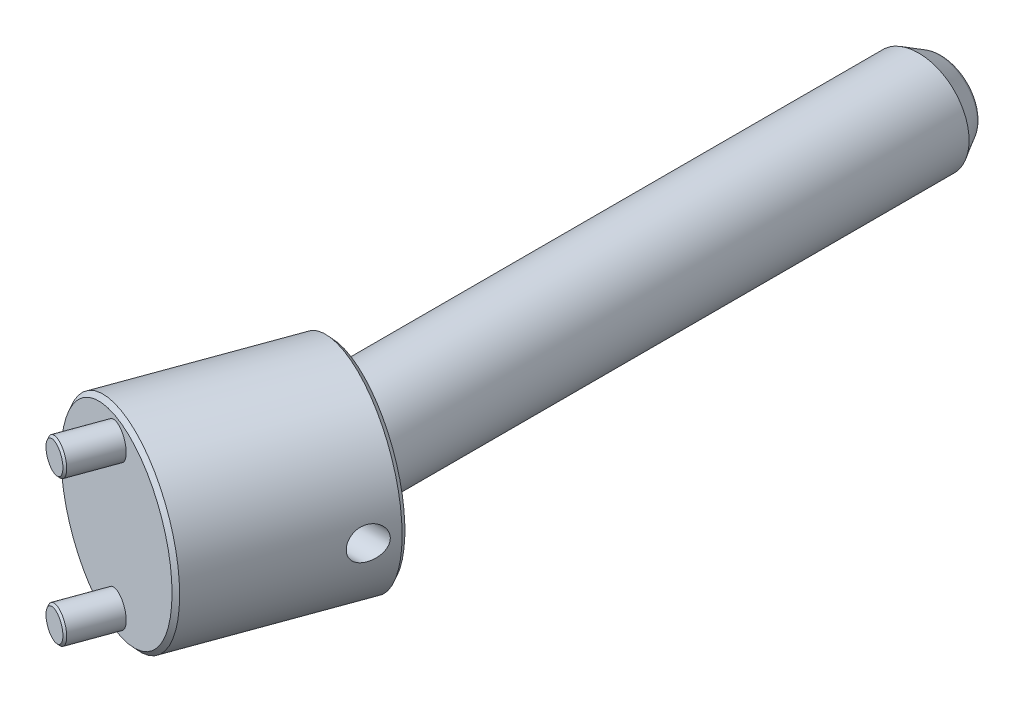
ISO-10303-21;
HEADER;
FILE_DESCRIPTION(('STEP AP214'),'2;1');
FILE_NAME('part.step','',(''),(''),'','','');
FILE_SCHEMA(('AUTOMOTIVE_DESIGN { 1 0 10303 214 1 1 1 1 }'));
ENDSEC;
DATA;
#1=APPLICATION_CONTEXT('core data for automotive mechanical design processes');
#2=APPLICATION_PROTOCOL_DEFINITION('international standard','automotive_design',2000,#1);
#3=PRODUCT_CONTEXT('',#1,'mechanical');
#4=PRODUCT('Part','Part','',(#3));
#5=PRODUCT_RELATED_PRODUCT_CATEGORY('part','',(#4));
#6=PRODUCT_DEFINITION_FORMATION('','',#4);
#7=PRODUCT_DEFINITION_CONTEXT('part definition',#1,'design');
#8=PRODUCT_DEFINITION('design','',#6,#7);
#9=PRODUCT_DEFINITION_SHAPE('','',#8);
#10=(LENGTH_UNIT() NAMED_UNIT(*) SI_UNIT(.MILLI.,.METRE.));
#11=(NAMED_UNIT(*) PLANE_ANGLE_UNIT() SI_UNIT($,.RADIAN.));
#12=(NAMED_UNIT(*) SI_UNIT($,.STERADIAN.) SOLID_ANGLE_UNIT());
#13=UNCERTAINTY_MEASURE_WITH_UNIT(LENGTH_MEASURE(1.E-05),#10,'distance_accuracy_value','');
#14=(GEOMETRIC_REPRESENTATION_CONTEXT(3) GLOBAL_UNCERTAINTY_ASSIGNED_CONTEXT((#13)) GLOBAL_UNIT_ASSIGNED_CONTEXT((#10,
#11,#12)) REPRESENTATION_CONTEXT('',''));
#15=CARTESIAN_POINT('',(0.,0.,0.));
#16=DIRECTION('',(0.,0.,1.));
#17=DIRECTION('',(1.,0.,0.));
#18=AXIS2_PLACEMENT_3D('',#15,#16,#17);
#19=CARTESIAN_POINT('',(0.,0.,-150.));
#20=DIRECTION('',(0.,0.,-1.));
#21=DIRECTION('',(0.,1.,0.));
#22=AXIS2_PLACEMENT_3D('',#19,#20,#21);
#23=PLANE('',#22);
#24=CARTESIAN_POINT('',(0.,0.,-150.));
#25=DIRECTION('',(0.,0.,1.));
#26=DIRECTION('',(-1.,0.,0.));
#27=AXIS2_PLACEMENT_3D('',#24,#25,#26);
#28=CIRCLE('',#27,7.881197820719);
#29=CARTESIAN_POINT('',(-7.8811978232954,0.,-150.));
#30=VERTEX_POINT('',#29);
#31=CARTESIAN_POINT('',(7.8811978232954,0.,-150.));
#32=VERTEX_POINT('',#31);
#33=EDGE_CURVE('P0_E38',#30,#32,#28,.T.);
#34=ORIENTED_EDGE('',*,*,#33,.F.);
#35=CARTESIAN_POINT('',(0.,0.,-150.));
#36=DIRECTION('',(0.,0.,1.));
#37=DIRECTION('',(1.,0.,0.));
#38=AXIS2_PLACEMENT_3D('',#35,#36,#37);
#39=CIRCLE('',#38,7.881197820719);
#40=EDGE_CURVE('P0_E42',#32,#30,#39,.T.);
#41=ORIENTED_EDGE('',*,*,#40,.F.);
#42=EDGE_LOOP('',(#34,#41));
#43=FACE_BOUND('',#42,.T.);
#44=ADVANCED_FACE('P0_F17',(#43),#23,.T.);
#45=CARTESIAN_POINT('',(0.,0.,-148.));
#46=DIRECTION('',(0.,0.,-1.));
#47=DIRECTION('',(0.999976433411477,-0.00686532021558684,0.));
#48=AXIS2_PLACEMENT_3D('',#45,#46,#47);
#49=TOROIDAL_SURFACE('',#48,7.881197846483,2.);
#50=ORIENTED_EDGE('',*,*,#33,.T.);
#51=ORIENTED_EDGE('',*,*,#40,.T.);
#52=EDGE_LOOP('',(#50,#51));
#53=FACE_BOUND('',#52,.T.);
#54=CARTESIAN_POINT('',(0.,0.,-149.000000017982));
#55=DIRECTION('',(0.,0.,1.));
#56=DIRECTION('',(1.,0.,0.));
#57=AXIS2_PLACEMENT_3D('',#54,#55,#56);
#58=CIRCLE('',#57,9.61324864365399);
#59=CARTESIAN_POINT('',(9.61324864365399,0.,-149.000000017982));
#60=VERTEX_POINT('',#59);
#61=EDGE_CURVE('P0_E48',#60,#60,#58,.T.);
#62=ORIENTED_EDGE('',*,*,#61,.F.);
#63=EDGE_LOOP('',(#62));
#64=FACE_BOUND('',#63,.T.);
#65=ADVANCED_FACE('P0_F40',(#53,#64),#49,.T.);
#66=CARTESIAN_POINT('',(0.,0.,37.5));
#67=DIRECTION('',(0.,0.,-1.));
#68=DIRECTION('',(0.,1.,0.));
#69=AXIS2_PLACEMENT_3D('',#66,#67,#68);
#70=PLANE('',#69);
#71=CARTESIAN_POINT('',(0.,0.,37.4999998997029));
#72=DIRECTION('',(0.,0.,-1.));
#73=DIRECTION('',(0.,1.,0.));
#74=AXIS2_PLACEMENT_3D('',#71,#72,#73);
#75=CIRCLE('',#74,11.4999995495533);
#76=CARTESIAN_POINT('',(0.,11.4999995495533,37.4999998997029));
#77=VERTEX_POINT('',#76);
#78=EDGE_CURVE('P0_E85',#77,#77,#75,.T.);
#79=ORIENTED_EDGE('',*,*,#78,.F.);
#80=EDGE_LOOP('',(#79));
#81=FACE_BOUND('',#80,.T.);
#82=ADVANCED_FACE('P0_F76',(#81),#70,.F.);
#83=CARTESIAN_POINT('',(4.30940107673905,0.,17.));
#84=DIRECTION('',(1.,0.,0.));
#85=DIRECTION('',(0.,0.,1.));
#86=AXIS2_PLACEMENT_3D('',#83,#84,#85);
#87=CONICAL_SURFACE('',#86,3.9999999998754,1.04719755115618);
#88=CARTESIAN_POINT('',(1.99999999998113,0.,16.9999999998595));
#89=VERTEX_POINT('',#88);
#90=VERTEX_LOOP('',#89);
#91=FACE_BOUND('',#90,.T.);
#92=CARTESIAN_POINT('',(4.309401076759,0.,17.));
#93=DIRECTION('',(1.,0.,0.));
#94=DIRECTION('',(0.,0.,1.));
#95=AXIS2_PLACEMENT_3D('',#92,#93,#94);
#96=CIRCLE('',#95,4.);
#97=CARTESIAN_POINT('',(4.309401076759,0.,21.));
#98=VERTEX_POINT('',#97);
#99=EDGE_CURVE('P0_E82',#98,#98,#96,.T.);
#100=ORIENTED_EDGE('',*,*,#99,.T.);
#101=EDGE_LOOP('',(#100));
#102=FACE_BOUND('',#101,.T.);
#103=ADVANCED_FACE('P0_F116',(#91,#102),#87,.F.);
#104=CARTESIAN_POINT('',(0.,0.,-143.999999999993));
#105=DIRECTION('',(0.,0.,1.));
#106=DIRECTION('',(0.,-1.,0.));
#107=AXIS2_PLACEMENT_3D('',#104,#105,#106);
#108=CONICAL_SURFACE('',#107,12.4999999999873,0.5235987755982);
#109=CARTESIAN_POINT('',(0.,0.,-144.));
#110=DIRECTION('',(0.,0.,-1.));
#111=DIRECTION('',(0.,1.,0.));
#112=AXIS2_PLACEMENT_3D('',#109,#110,#111);
#113=CIRCLE('',#112,12.5);
#114=CARTESIAN_POINT('',(0.,12.5,-144.));
#115=VERTEX_POINT('',#114);
#116=EDGE_CURVE('P0_E92',#115,#115,#113,.F.);
#117=ORIENTED_EDGE('',*,*,#116,.F.);
#118=EDGE_LOOP('',(#117));
#119=FACE_BOUND('',#118,.T.);
#120=ORIENTED_EDGE('',*,*,#61,.T.);
#121=EDGE_LOOP('',(#120));
#122=FACE_BOUND('',#121,.T.);
#123=ADVANCED_FACE('P0_F108',(#119,#122),#108,.T.);
#124=CARTESIAN_POINT('',(0.,0.,36.4999995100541));
#125=DIRECTION('',(0.,0.,-1.));
#126=DIRECTION('',(0.,1.,0.));
#127=AXIS2_PLACEMENT_3D('',#124,#125,#126);
#128=CONICAL_SURFACE('',#127,12.4999998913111,0.785398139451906);
#129=CARTESIAN_POINT('',(0.,0.,36.499999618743));
#130=DIRECTION('',(0.,0.,-1.));
#131=DIRECTION('',(0.,1.,0.));
#132=AXIS2_PLACEMENT_3D('',#129,#130,#131);
#133=CIRCLE('',#132,12.5);
#134=CARTESIAN_POINT('',(0.,12.5,36.499999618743));
#135=VERTEX_POINT('',#134);
#136=EDGE_CURVE('P0_E28',#135,#135,#133,.T.);
#137=ORIENTED_EDGE('',*,*,#136,.F.);
#138=EDGE_LOOP('',(#137));
#139=FACE_BOUND('',#138,.T.);
#140=ORIENTED_EDGE('',*,*,#78,.T.);
#141=EDGE_LOOP('',(#140));
#142=FACE_BOUND('',#141,.T.);
#143=ADVANCED_FACE('P0_F105',(#139,#142),#128,.T.);
#144=CARTESIAN_POINT('',(1.375,0.,17.));
#145=DIRECTION('',(1.,0.,0.));
#146=DIRECTION('',(0.,0.,1.));
#147=AXIS2_PLACEMENT_3D('',#144,#145,#146);
#148=CYLINDRICAL_SURFACE('',#147,4.);
#149=ORIENTED_EDGE('',*,*,#99,.F.);
#150=EDGE_LOOP('',(#149));
#151=FACE_BOUND('',#150,.T.);
#152=CARTESIAN_POINT('',(12.5,0.,21.));
#153=CARTESIAN_POINT('',(12.4999998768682,0.109267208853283,20.9999998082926));
#154=CARTESIAN_POINT('',(12.4985638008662,0.218537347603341,20.9955187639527));
#155=CARTESIAN_POINT('',(12.4928582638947,0.436308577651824,20.9776347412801));
#156=CARTESIAN_POINT('',(12.4885877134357,0.544809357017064,20.9642283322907));
#157=CARTESIAN_POINT('',(12.4773197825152,0.760358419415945,20.9285872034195));
#158=CARTESIAN_POINT('',(12.4703188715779,0.867404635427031,20.9063410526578));
#159=CARTESIAN_POINT('',(12.4537844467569,1.07914970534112,20.853228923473));
#160=CARTESIAN_POINT('',(12.4442499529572,1.18384763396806,20.8223596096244));
#161=CARTESIAN_POINT('',(12.412260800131,1.49277788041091,20.7173557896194));
#162=CARTESIAN_POINT('',(12.3863805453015,1.69256281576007,20.6307055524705));
#163=CARTESIAN_POINT('',(12.3281610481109,2.07458913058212,20.4268128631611));
#164=CARTESIAN_POINT('',(12.295822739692,2.25683304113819,20.3095748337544));
#165=CARTESIAN_POINT('',(12.2269279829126,2.60472253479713,20.043795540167));
#166=CARTESIAN_POINT('',(12.1902760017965,2.76972880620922,19.8944408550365));
#167=CARTESIAN_POINT('',(12.1174284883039,3.07283077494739,19.5704010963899));
#168=CARTESIAN_POINT('',(12.0812330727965,3.21091970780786,19.3957096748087));
#169=CARTESIAN_POINT('',(12.01237020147,3.45978450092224,19.0203675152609));
#170=CARTESIAN_POINT('',(11.9798194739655,3.56975347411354,18.8191582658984));
#171=CARTESIAN_POINT('',(11.9233663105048,3.75402351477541,18.399892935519));
#172=CARTESIAN_POINT('',(11.8994614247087,3.82833468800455,18.1818416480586));
#173=CARTESIAN_POINT('',(11.8640030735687,3.93682830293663,17.7422935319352));
#174=CARTESIAN_POINT('',(11.8520853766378,3.97219740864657,17.5211198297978));
#175=CARTESIAN_POINT('',(11.8408707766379,4.00551082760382,17.0756810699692));
#176=CARTESIAN_POINT('',(11.8415703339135,4.00346563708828,16.8514168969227));
#177=CARTESIAN_POINT('',(11.8551904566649,3.96293460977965,16.4160865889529));
#178=CARTESIAN_POINT('',(11.8676003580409,3.92597140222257,16.2048599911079));
#179=CARTESIAN_POINT('',(11.9024113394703,3.81912665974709,15.791778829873));
#180=CARTESIAN_POINT('',(11.9248135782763,3.74924130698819,15.5899253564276));
#181=CARTESIAN_POINT('',(11.9774670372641,3.5774893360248,15.1977500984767));
#182=CARTESIAN_POINT('',(12.0078322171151,3.47515345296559,15.0076498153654));
#183=CARTESIAN_POINT('',(12.0729382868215,3.2417276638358,14.6468343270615));
#184=CARTESIAN_POINT('',(12.107680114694,3.11063158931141,14.4761232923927));
#185=CARTESIAN_POINT('',(12.1796519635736,2.81604951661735,14.1503715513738));
#186=CARTESIAN_POINT('',(12.2169216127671,2.65131653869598,13.9964671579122));
#187=CARTESIAN_POINT('',(12.2883204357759,2.29773509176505,13.7180823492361));
#188=CARTESIAN_POINT('',(12.3224482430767,2.10887621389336,13.5936147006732));
#189=CARTESIAN_POINT('',(12.368603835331,1.8105187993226,13.4313785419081));
#190=CARTESIAN_POINT('',(12.3832112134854,1.70799133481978,13.3811846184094));
#191=CARTESIAN_POINT('',(12.4102662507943,1.49879447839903,13.2896595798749));
#192=CARTESIAN_POINT('',(12.4227147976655,1.39212681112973,13.2483248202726));
#193=CARTESIAN_POINT('',(12.4450730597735,1.17558171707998,13.1749428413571));
#194=CARTESIAN_POINT('',(12.4549867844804,1.0657096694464,13.1428809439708));
#195=CARTESIAN_POINT('',(12.4720081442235,0.843458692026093,13.0882661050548));
#196=CARTESIAN_POINT('',(12.4791170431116,0.731080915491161,13.0657088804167));
#197=CARTESIAN_POINT('',(12.4897717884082,0.515800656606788,13.0320501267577));
#198=CARTESIAN_POINT('',(12.4935992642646,0.413053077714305,13.0200402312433));
#199=CARTESIAN_POINT('',(12.498713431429,0.206871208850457,13.0040150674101));
#200=CARTESIAN_POINT('',(12.5000001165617,0.103436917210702,12.9999998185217));
#201=CARTESIAN_POINT('',(12.4999998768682,-0.109267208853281,13.0000001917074));
#202=CARTESIAN_POINT('',(12.4985638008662,-0.218537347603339,13.0044812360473));
#203=CARTESIAN_POINT('',(12.4928582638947,-0.436308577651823,13.0223652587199));
#204=CARTESIAN_POINT('',(12.4885877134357,-0.544809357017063,13.0357716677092));
#205=CARTESIAN_POINT('',(12.4773197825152,-0.760358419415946,13.0714127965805));
#206=CARTESIAN_POINT('',(12.4703188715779,-0.867404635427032,13.0936589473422));
#207=CARTESIAN_POINT('',(12.4537844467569,-1.07914970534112,13.146771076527));
#208=CARTESIAN_POINT('',(12.4442499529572,-1.18384763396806,13.1776403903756));
#209=CARTESIAN_POINT('',(12.412260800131,-1.4927778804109,13.2826442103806));
#210=CARTESIAN_POINT('',(12.3863805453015,-1.69256281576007,13.3692944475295));
#211=CARTESIAN_POINT('',(12.3281610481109,-2.07458913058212,13.5731871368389));
#212=CARTESIAN_POINT('',(12.295822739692,-2.25683304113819,13.6904251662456));
#213=CARTESIAN_POINT('',(12.2269279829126,-2.60472253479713,13.956204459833));
#214=CARTESIAN_POINT('',(12.1902760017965,-2.76972880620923,14.1055591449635));
#215=CARTESIAN_POINT('',(12.1174284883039,-3.0728307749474,14.4295989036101));
#216=CARTESIAN_POINT('',(12.0812330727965,-3.21091970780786,14.6042903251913));
#217=CARTESIAN_POINT('',(12.01237020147,-3.45978450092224,14.9796324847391));
#218=CARTESIAN_POINT('',(11.9798194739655,-3.56975347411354,15.1808417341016));
#219=CARTESIAN_POINT('',(11.9233663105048,-3.75402351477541,15.600107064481));
#220=CARTESIAN_POINT('',(11.8994614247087,-3.82833468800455,15.8181583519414));
#221=CARTESIAN_POINT('',(11.8640030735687,-3.93682830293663,16.2577064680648));
#222=CARTESIAN_POINT('',(11.8520853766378,-3.97219740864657,16.4788801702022));
#223=CARTESIAN_POINT('',(11.8408707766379,-4.00551082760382,16.9243189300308));
#224=CARTESIAN_POINT('',(11.8415703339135,-4.00346563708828,17.1485831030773));
#225=CARTESIAN_POINT('',(11.8551904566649,-3.96293460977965,17.583913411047));
#226=CARTESIAN_POINT('',(11.8676003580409,-3.92597140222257,17.7951400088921));
#227=CARTESIAN_POINT('',(11.9024113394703,-3.81912665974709,18.208221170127));
#228=CARTESIAN_POINT('',(11.9248135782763,-3.74924130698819,18.4100746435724));
#229=CARTESIAN_POINT('',(11.9774670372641,-3.5774893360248,18.8022499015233));
#230=CARTESIAN_POINT('',(12.0078322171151,-3.47515345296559,18.9923501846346));
#231=CARTESIAN_POINT('',(12.0729382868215,-3.2417276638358,19.3531656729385));
#232=CARTESIAN_POINT('',(12.107680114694,-3.11063158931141,19.5238767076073));
#233=CARTESIAN_POINT('',(12.1796519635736,-2.81604951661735,19.8496284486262));
#234=CARTESIAN_POINT('',(12.2169216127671,-2.65131653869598,20.0035328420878));
#235=CARTESIAN_POINT('',(12.2883204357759,-2.29773509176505,20.2819176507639));
#236=CARTESIAN_POINT('',(12.3224482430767,-2.10887621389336,20.4063852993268));
#237=CARTESIAN_POINT('',(12.368603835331,-1.8105187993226,20.5686214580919));
#238=CARTESIAN_POINT('',(12.3832112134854,-1.70799133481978,20.6188153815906));
#239=CARTESIAN_POINT('',(12.4102662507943,-1.49879447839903,20.7103404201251));
#240=CARTESIAN_POINT('',(12.4227147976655,-1.39212681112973,20.7516751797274));
#241=CARTESIAN_POINT('',(12.4450730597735,-1.17558171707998,20.8250571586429));
#242=CARTESIAN_POINT('',(12.4549867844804,-1.0657096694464,20.8571190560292));
#243=CARTESIAN_POINT('',(12.4720081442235,-0.843458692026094,20.9117338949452));
#244=CARTESIAN_POINT('',(12.4791170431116,-0.731080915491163,20.9342911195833));
#245=CARTESIAN_POINT('',(12.4897717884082,-0.515800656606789,20.9679498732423));
#246=CARTESIAN_POINT('',(12.4935992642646,-0.413053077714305,20.9799597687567));
#247=CARTESIAN_POINT('',(12.498713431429,-0.206871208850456,20.9959849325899));
#248=CARTESIAN_POINT('',(12.5000001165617,-0.103436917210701,21.0000001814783));
#249=CARTESIAN_POINT('',(12.5,0.,21.));
#250=B_SPLINE_CURVE_WITH_KNOTS('',3,(#152,#153,#154,#155,#156,#157,#158,#159,#160,#161,#162,
#163,#164,#165,#166,#167,#168,#169,#170,#171,#172,#173,#174,#175,#176,#177,#178,#179,#180,#181,
#182,#183,#184,#185,#186,#187,#188,#189,#190,#191,#192,#193,#194,#195,#196,#197,#198,#199,#200,
#201,#202,#203,#204,#205,#206,#207,#208,#209,#210,#211,#212,#213,#214,#215,#216,#217,#218,#219,
#220,#221,#222,#223,#224,#225,#226,#227,#228,#229,#230,#231,#232,#233,#234,#235,#236,#237,#238,
#239,#240,#241,#242,#243,#244,#245,#246,#247,#248,#249),.UNSPECIFIED.,.T.,.F.,(4,2,2,2,2,2,2,2,
2,2,2,2,2,2,2,2,2,2,2,2,2,2,2,2,2,2,2,2,2,2,2,2,2,2,2,2,2,2,2,2,2,2,2,2,2,2,2,2,4),(0.,
0.327705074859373,0.655536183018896,0.983792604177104,1.31217617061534,1.96678919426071,
2.62130761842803,3.29492000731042,3.96870146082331,4.66006760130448,5.35123768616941,
6.0207071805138,6.68998886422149,7.33137068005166,7.97282689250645,8.62401811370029,
9.27534913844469,9.95775723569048,10.6404607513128,10.9853574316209,11.3301119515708,
11.6743177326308,12.0183682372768,12.3285868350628,12.6388061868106,12.9665112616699,
13.2943423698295,13.6225987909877,13.9509823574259,14.6055953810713,15.2601138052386,
15.933726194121,16.6075076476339,17.298873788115,17.99004387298,18.6595133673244,
19.3287950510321,19.9701768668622,20.611633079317,21.2628243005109,21.9141553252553,
22.596563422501,23.2792669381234,23.6241636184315,23.9689181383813,24.3131239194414,
24.6571744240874,24.9673930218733,25.2776123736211),.UNSPECIFIED.);
#251=CARTESIAN_POINT('',(12.5,0.,21.));
#252=VERTEX_POINT('',#251);
#253=EDGE_CURVE('P0_E11',#252,#252,#250,.T.);
#254=ORIENTED_EDGE('',*,*,#253,.F.);
#255=EDGE_LOOP('',(#254));
#256=FACE_BOUND('',#255,.T.);
#257=ADVANCED_FACE('P0_F107',(#151,#256),#148,.F.);
#258=CARTESIAN_POINT('',(0.,0.,46.875));
#259=DIRECTION('',(0.,0.,-1.));
#260=DIRECTION('',(0.,1.,0.));
#261=AXIS2_PLACEMENT_3D('',#258,#259,#260);
#262=CYLINDRICAL_SURFACE('',#261,12.5);
#263=ORIENTED_EDGE('',*,*,#116,.T.);
#264=EDGE_LOOP('',(#263));
#265=FACE_BOUND('',#264,.T.);
#266=ORIENTED_EDGE('',*,*,#136,.T.);
#267=EDGE_LOOP('',(#266));
#268=FACE_BOUND('',#267,.T.);
#269=ORIENTED_EDGE('',*,*,#253,.T.);
#270=EDGE_LOOP('',(#269));
#271=FACE_BOUND('',#270,.T.);
#272=ADVANCED_FACE('P0_F102',(#265,#268,#271),#262,.T.);
#273=CLOSED_SHELL('',(#44,#65,#82,#103,#123,#143,#257,#272));
#274=MANIFOLD_SOLID_BREP('P0_B1',#273);
#275=CARTESIAN_POINT('',(-14.7966850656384,0.,55.2725801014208));
#276=DIRECTION('',(-0.342020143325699,0.,0.939692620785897));
#277=DIRECTION('',(-0.939692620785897,0.,-0.342020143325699));
#278=AXIS2_PLACEMENT_3D('',#275,#276,#277);
#279=PLANE('',#278);
#280=CARTESIAN_POINT('',(-14.7966850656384,18.,55.2725801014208));
#281=DIRECTION('',(-0.342020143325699,0.,0.939692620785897));
#282=DIRECTION('',(-0.939692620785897,0.,-0.342020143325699));
#283=AXIS2_PLACEMENT_3D('',#280,#281,#282);
#284=CIRCLE('',#283,3.50000030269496);
#285=CARTESIAN_POINT('',(-18.0856095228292,18.,54.0755094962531));
#286=VERTEX_POINT('',#285);
#287=EDGE_CURVE('P1_E17',#286,#286,#284,.F.);
#288=ORIENTED_EDGE('',*,*,#287,.F.);
#289=EDGE_LOOP('',(#288));
#290=FACE_BOUND('',#289,.T.);
#291=ADVANCED_FACE('P1_F14',(#290),#279,.T.);
#292=CARTESIAN_POINT('',(-14.7966850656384,0.,55.2725801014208));
#293=DIRECTION('',(-0.342020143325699,0.,0.939692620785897));
#294=DIRECTION('',(-0.939692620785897,0.,-0.342020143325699));
#295=AXIS2_PLACEMENT_3D('',#292,#293,#294);
#296=PLANE('',#295);
#297=CARTESIAN_POINT('',(-14.7966850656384,-18.,55.2725801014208));
#298=DIRECTION('',(-0.342020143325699,0.,0.939692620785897));
#299=DIRECTION('',(-0.939692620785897,0.,-0.342020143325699));
#300=AXIS2_PLACEMENT_3D('',#297,#298,#299);
#301=CIRCLE('',#300,3.50000030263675);
#302=CARTESIAN_POINT('',(-18.0856095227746,-18.,54.075509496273));
#303=VERTEX_POINT('',#302);
#304=EDGE_CURVE('P1_E121',#303,#303,#301,.F.);
#305=ORIENTED_EDGE('',*,*,#304,.F.);
#306=EDGE_LOOP('',(#305));
#307=FACE_BOUND('',#306,.T.);
#308=ADVANCED_FACE('P1_F111',(#307),#296,.T.);
#309=CARTESIAN_POINT('',(-3.98986399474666E-12,0.,37.4999999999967));
#310=DIRECTION('',(0.,0.,1.));
#311=DIRECTION('',(-1.,0.,0.));
#312=AXIS2_PLACEMENT_3D('',#309,#310,#311);
#313=PLANE('',#312);
#314=CARTESIAN_POINT('',(-4.41834069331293E-12,0.,37.4999999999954));
#315=DIRECTION('',(0.,0.,1.));
#316=DIRECTION('',(-1.,0.,0.));
#317=AXIS2_PLACEMENT_3D('',#314,#315,#316);
#318=CIRCLE('',#317,12.5);
#319=CARTESIAN_POINT('',(-12.5000000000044,0.,37.4999999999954));
#320=VERTEX_POINT('',#319);
#321=EDGE_CURVE('P1_E36',#320,#320,#318,.F.);
#322=ORIENTED_EDGE('',*,*,#321,.T.);
#323=EDGE_LOOP('',(#322));
#324=FACE_BOUND('',#323,.T.);
#325=ADVANCED_FACE('P1_F108',(#324),#313,.F.);
#326=CARTESIAN_POINT('',(-14.6256745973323,18.,54.8027327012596));
#327=DIRECTION('',(0.342020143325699,0.,-0.939692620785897));
#328=DIRECTION('',(0.939692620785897,0.,0.342020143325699));
#329=AXIS2_PLACEMENT_3D('',#326,#327,#328);
#330=CONICAL_SURFACE('',#329,4.00000150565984,0.785398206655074);
#331=CARTESIAN_POINT('',(-14.6256740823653,18.,54.8027312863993));
#332=DIRECTION('',(-0.342020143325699,0.,0.939692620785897));
#333=DIRECTION('',(-0.939692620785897,0.,-0.342020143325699));
#334=AXIS2_PLACEMENT_3D('',#331,#332,#333);
#335=CIRCLE('',#334,4.);
#336=CARTESIAN_POINT('',(-18.3844445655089,18.,53.4346507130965));
#337=VERTEX_POINT('',#336);
#338=EDGE_CURVE('P1_E33',#337,#337,#335,.F.);
#339=ORIENTED_EDGE('',*,*,#338,.F.);
#340=EDGE_LOOP('',(#339));
#341=FACE_BOUND('',#340,.T.);
#342=ORIENTED_EDGE('',*,*,#287,.T.);
#343=EDGE_LOOP('',(#342));
#344=FACE_BOUND('',#343,.T.);
#345=ADVANCED_FACE('P1_F104',(#341,#344),#330,.T.);
#346=CARTESIAN_POINT('',(-14.6256745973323,-18.,54.8027327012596));
#347=DIRECTION('',(0.342020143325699,0.,-0.939692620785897));
#348=DIRECTION('',(0.939692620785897,0.,0.342020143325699));
#349=AXIS2_PLACEMENT_3D('',#346,#347,#348);
#350=CONICAL_SURFACE('',#349,4.00000150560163,0.785398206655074);
#351=CARTESIAN_POINT('',(-14.6256740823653,-18.,54.8027312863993));
#352=DIRECTION('',(-0.342020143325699,0.,0.939692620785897));
#353=DIRECTION('',(-0.939692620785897,0.,-0.342020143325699));
#354=AXIS2_PLACEMENT_3D('',#351,#352,#353);
#355=CIRCLE('',#354,4.);
#356=CARTESIAN_POINT('',(-18.3844445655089,-18.,53.4346507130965));
#357=VERTEX_POINT('',#356);
#358=EDGE_CURVE('P1_E29',#357,#357,#355,.F.);
#359=ORIENTED_EDGE('',*,*,#358,.F.);
#360=EDGE_LOOP('',(#359));
#361=FACE_BOUND('',#360,.T.);
#362=ORIENTED_EDGE('',*,*,#304,.T.);
#363=EDGE_LOOP('',(#362));
#364=FACE_BOUND('',#363,.T.);
#365=ADVANCED_FACE('P1_F99',(#361,#364),#350,.T.);
#366=CARTESIAN_POINT('',(-4.41834069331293E-12,0.,-16.7941648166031));
#367=DIRECTION('',(0.,0.,1.));
#368=DIRECTION('',(-1.,0.,0.));
#369=AXIS2_PLACEMENT_3D('',#366,#367,#368);
#370=CYLINDRICAL_SURFACE('',#369,12.5);
#371=CARTESIAN_POINT('',(-4.41834069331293E-12,0.,-4.37844205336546E-12));
#372=DIRECTION('',(0.342020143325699,0.,-0.939692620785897));
#373=DIRECTION('',(0.939692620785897,0.,0.342020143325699));
#374=AXIS2_PLACEMENT_3D('',#371,#372,#373);
#375=ELLIPSE('',#374,13.3022221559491,12.5);
#376=CARTESIAN_POINT('',(12.4999999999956,0.,4.54962792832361));
#377=VERTEX_POINT('',#376);
#378=EDGE_CURVE('P1_E32',#377,#377,#375,.F.);
#379=ORIENTED_EDGE('',*,*,#378,.F.);
#380=EDGE_LOOP('',(#379));
#381=FACE_BOUND('',#380,.T.);
#382=ORIENTED_EDGE('',*,*,#321,.F.);
#383=EDGE_LOOP('',(#382));
#384=FACE_BOUND('',#383,.T.);
#385=CARTESIAN_POINT('',(12.4999999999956,0.,12.9999999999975));
#386=CARTESIAN_POINT('',(12.4999998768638,0.109267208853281,13.000000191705));
#387=CARTESIAN_POINT('',(12.4985638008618,0.218537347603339,13.0044812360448));
#388=CARTESIAN_POINT('',(12.4928582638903,0.436308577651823,13.0223652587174));
#389=CARTESIAN_POINT('',(12.4885877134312,0.544809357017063,13.0357716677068));
#390=CARTESIAN_POINT('',(12.4773197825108,0.760358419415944,13.071412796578));
#391=CARTESIAN_POINT('',(12.4703188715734,0.86740463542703,13.0936589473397));
#392=CARTESIAN_POINT('',(12.4537844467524,1.07914970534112,13.1467710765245));
#393=CARTESIAN_POINT('',(12.4442499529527,1.18384763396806,13.1776403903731));
#394=CARTESIAN_POINT('',(12.4122608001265,1.4927778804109,13.2826442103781));
#395=CARTESIAN_POINT('',(12.386380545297,1.69256281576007,13.369294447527));
#396=CARTESIAN_POINT('',(12.3281610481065,2.07458913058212,13.5731871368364));
#397=CARTESIAN_POINT('',(12.2958227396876,2.25683304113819,13.6904251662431));
#398=CARTESIAN_POINT('',(12.2269279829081,2.60472253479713,13.9562044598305));
#399=CARTESIAN_POINT('',(12.1902760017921,2.76972880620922,14.105559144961));
#400=CARTESIAN_POINT('',(12.1174284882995,3.07283077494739,14.4295989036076));
#401=CARTESIAN_POINT('',(12.0812330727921,3.21091970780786,14.6042903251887));
#402=CARTESIAN_POINT('',(12.0123702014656,3.45978450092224,14.9796324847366));
#403=CARTESIAN_POINT('',(11.9798194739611,3.56975347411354,15.1808417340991));
#404=CARTESIAN_POINT('',(11.9233663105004,3.75402351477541,15.6001070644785));
#405=CARTESIAN_POINT('',(11.8994614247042,3.82833468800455,15.8181583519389));
#406=CARTESIAN_POINT('',(11.8640030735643,3.93682830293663,16.2577064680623));
#407=CARTESIAN_POINT('',(11.8520853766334,3.97219740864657,16.4788801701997));
#408=CARTESIAN_POINT('',(11.8408707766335,4.00551082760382,16.9243189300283));
#409=CARTESIAN_POINT('',(11.8415703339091,4.00346563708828,17.1485831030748));
#410=CARTESIAN_POINT('',(11.8551904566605,3.96293460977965,17.5839134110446));
#411=CARTESIAN_POINT('',(11.8676003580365,3.92597140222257,17.7951400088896));
#412=CARTESIAN_POINT('',(11.9024113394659,3.81912665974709,18.2082211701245));
#413=CARTESIAN_POINT('',(11.9248135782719,3.74924130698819,18.4100746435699));
#414=CARTESIAN_POINT('',(11.9774670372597,3.5774893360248,18.8022499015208));
#415=CARTESIAN_POINT('',(12.0078322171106,3.47515345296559,18.9923501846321));
#416=CARTESIAN_POINT('',(12.0729382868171,3.2417276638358,19.353165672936));
#417=CARTESIAN_POINT('',(12.1076801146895,3.11063158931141,19.5238767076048));
#418=CARTESIAN_POINT('',(12.1796519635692,2.81604951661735,19.8496284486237));
#419=CARTESIAN_POINT('',(12.2169216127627,2.65131653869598,20.0035328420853));
#420=CARTESIAN_POINT('',(12.2883204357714,2.29773509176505,20.2819176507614));
#421=CARTESIAN_POINT('',(12.3224482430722,2.10887621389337,20.4063852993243));
#422=CARTESIAN_POINT('',(12.3686038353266,1.81051879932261,20.5686214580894));
#423=CARTESIAN_POINT('',(12.383211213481,1.70799133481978,20.6188153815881));
#424=CARTESIAN_POINT('',(12.4102662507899,1.49879447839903,20.7103404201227));
#425=CARTESIAN_POINT('',(12.422714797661,1.39212681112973,20.7516751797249));
#426=CARTESIAN_POINT('',(12.4450730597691,1.17558171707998,20.8250571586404));
#427=CARTESIAN_POINT('',(12.454986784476,1.0657096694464,20.8571190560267));
#428=CARTESIAN_POINT('',(12.4720081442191,0.843458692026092,20.9117338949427));
#429=CARTESIAN_POINT('',(12.4791170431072,0.731080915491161,20.9342911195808));
#430=CARTESIAN_POINT('',(12.4897717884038,0.515800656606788,20.9679498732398));
#431=CARTESIAN_POINT('',(12.4935992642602,0.413053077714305,20.9799597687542));
#432=CARTESIAN_POINT('',(12.4987134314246,0.206871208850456,20.9959849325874));
#433=CARTESIAN_POINT('',(12.5000001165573,0.103436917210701,21.0000001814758));
#434=CARTESIAN_POINT('',(12.4999998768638,-0.109267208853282,20.9999998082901));
#435=CARTESIAN_POINT('',(12.4985638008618,-0.21853734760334,20.9955187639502));
#436=CARTESIAN_POINT('',(12.4928582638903,-0.436308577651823,20.9776347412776));
#437=CARTESIAN_POINT('',(12.4885877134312,-0.544809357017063,20.9642283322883));
#438=CARTESIAN_POINT('',(12.4773197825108,-0.760358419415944,20.928587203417));
#439=CARTESIAN_POINT('',(12.4703188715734,-0.86740463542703,20.9063410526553));
#440=CARTESIAN_POINT('',(12.4537844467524,-1.07914970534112,20.8532289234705));
#441=CARTESIAN_POINT('',(12.4442499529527,-1.18384763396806,20.8223596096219));
#442=CARTESIAN_POINT('',(12.4122608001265,-1.4927778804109,20.717355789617));
#443=CARTESIAN_POINT('',(12.386380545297,-1.69256281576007,20.630705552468));
#444=CARTESIAN_POINT('',(12.3281610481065,-2.07458913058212,20.4268128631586));
#445=CARTESIAN_POINT('',(12.2958227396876,-2.25683304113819,20.3095748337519));
#446=CARTESIAN_POINT('',(12.2269279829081,-2.60472253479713,20.0437955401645));
#447=CARTESIAN_POINT('',(12.1902760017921,-2.76972880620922,19.894440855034));
#448=CARTESIAN_POINT('',(12.1174284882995,-3.07283077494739,19.5704010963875));
#449=CARTESIAN_POINT('',(12.0812330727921,-3.21091970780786,19.3957096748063));
#450=CARTESIAN_POINT('',(12.0123702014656,-3.45978450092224,19.0203675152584));
#451=CARTESIAN_POINT('',(11.979819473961,-3.56975347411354,18.8191582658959));
#452=CARTESIAN_POINT('',(11.9233663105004,-3.75402351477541,18.3998929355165));
#453=CARTESIAN_POINT('',(11.8994614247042,-3.82833468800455,18.1818416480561));
#454=CARTESIAN_POINT('',(11.8640030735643,-3.93682830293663,17.7422935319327));
#455=CARTESIAN_POINT('',(11.8520853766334,-3.97219740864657,17.5211198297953));
#456=CARTESIAN_POINT('',(11.8408707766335,-4.00551082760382,17.0756810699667));
#457=CARTESIAN_POINT('',(11.8415703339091,-4.00346563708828,16.8514168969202));
#458=CARTESIAN_POINT('',(11.8551904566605,-3.96293460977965,16.4160865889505));
#459=CARTESIAN_POINT('',(11.8676003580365,-3.92597140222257,16.2048599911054));
#460=CARTESIAN_POINT('',(11.9024113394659,-3.81912665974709,15.7917788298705));
#461=CARTESIAN_POINT('',(11.9248135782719,-3.74924130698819,15.5899253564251));
#462=CARTESIAN_POINT('',(11.9774670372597,-3.5774893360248,15.1977500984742));
#463=CARTESIAN_POINT('',(12.0078322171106,-3.47515345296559,15.0076498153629));
#464=CARTESIAN_POINT('',(12.0729382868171,-3.2417276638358,14.646834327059));
#465=CARTESIAN_POINT('',(12.1076801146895,-3.11063158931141,14.4761232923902));
#466=CARTESIAN_POINT('',(12.1796519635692,-2.81604951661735,14.1503715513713));
#467=CARTESIAN_POINT('',(12.2169216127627,-2.65131653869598,13.9964671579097));
#468=CARTESIAN_POINT('',(12.2883204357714,-2.29773509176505,13.7180823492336));
#469=CARTESIAN_POINT('',(12.3224482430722,-2.10887621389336,13.5936147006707));
#470=CARTESIAN_POINT('',(12.3686038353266,-1.81051879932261,13.4313785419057));
#471=CARTESIAN_POINT('',(12.383211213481,-1.70799133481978,13.3811846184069));
#472=CARTESIAN_POINT('',(12.4102662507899,-1.49879447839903,13.2896595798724));
#473=CARTESIAN_POINT('',(12.422714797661,-1.39212681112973,13.2483248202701));
#474=CARTESIAN_POINT('',(12.4450730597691,-1.17558171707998,13.1749428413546));
#475=CARTESIAN_POINT('',(12.454986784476,-1.0657096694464,13.1428809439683));
#476=CARTESIAN_POINT('',(12.4720081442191,-0.843458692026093,13.0882661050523));
#477=CARTESIAN_POINT('',(12.4791170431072,-0.731080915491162,13.0657088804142));
#478=CARTESIAN_POINT('',(12.4897717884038,-0.51580065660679,13.0320501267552));
#479=CARTESIAN_POINT('',(12.4935992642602,-0.413053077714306,13.0200402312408));
#480=CARTESIAN_POINT('',(12.4987134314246,-0.206871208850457,13.0040150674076));
#481=CARTESIAN_POINT('',(12.5000001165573,-0.103436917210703,12.9999998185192));
#482=CARTESIAN_POINT('',(12.4999999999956,0.,12.9999999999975));
#483=B_SPLINE_CURVE_WITH_KNOTS('',3,(#385,#386,#387,#388,#389,#390,#391,#392,#393,#394,#395,
#396,#397,#398,#399,#400,#401,#402,#403,#404,#405,#406,#407,#408,#409,#410,#411,#412,#413,#414,
#415,#416,#417,#418,#419,#420,#421,#422,#423,#424,#425,#426,#427,#428,#429,#430,#431,#432,#433,
#434,#435,#436,#437,#438,#439,#440,#441,#442,#443,#444,#445,#446,#447,#448,#449,#450,#451,#452,
#453,#454,#455,#456,#457,#458,#459,#460,#461,#462,#463,#464,#465,#466,#467,#468,#469,#470,#471,
#472,#473,#474,#475,#476,#477,#478,#479,#480,#481,#482),.UNSPECIFIED.,.T.,.F.,(4,2,2,2,2,2,2,2,
2,2,2,2,2,2,2,2,2,2,2,2,2,2,2,2,2,2,2,2,2,2,2,2,2,2,2,2,2,2,2,2,2,2,2,2,2,2,2,2,4),(0.,
0.327705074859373,0.655536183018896,0.983792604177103,1.31217617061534,1.9667891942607,
2.62130761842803,3.29492000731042,3.9687014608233,4.66006760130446,5.3512376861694,
6.0207071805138,6.68998886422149,7.33137068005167,7.97282689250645,8.62401811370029,
9.27534913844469,9.95775723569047,10.6404607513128,10.9853574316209,11.3301119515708,
11.6743177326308,12.0183682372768,12.3285868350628,12.6388061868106,12.9665112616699,
13.2943423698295,13.6225987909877,13.9509823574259,14.6055953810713,15.2601138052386,
15.933726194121,16.6075076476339,17.298873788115,17.99004387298,18.6595133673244,
19.3287950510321,19.9701768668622,20.611633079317,21.2628243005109,21.9141553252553,
22.596563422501,23.2792669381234,23.6241636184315,23.9689181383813,24.3131239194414,
24.6571744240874,24.9673930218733,25.2776123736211),.UNSPECIFIED.);
#484=CARTESIAN_POINT('',(12.4999999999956,0.,12.9999999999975));
#485=VERTEX_POINT('',#484);
#486=EDGE_CURVE('P1_E84',#485,#485,#483,.T.);
#487=ORIENTED_EDGE('',*,*,#486,.T.);
#488=EDGE_LOOP('',(#487));
#489=FACE_BOUND('',#488,.T.);
#490=ADVANCED_FACE('P1_F93',(#381,#384,#489),#370,.F.);
#491=CARTESIAN_POINT('',(-10.69244334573,18.,43.99626865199));
#492=DIRECTION('',(-0.342020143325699,0.,0.939692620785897));
#493=DIRECTION('',(-0.939692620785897,0.,-0.342020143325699));
#494=AXIS2_PLACEMENT_3D('',#491,#492,#493);
#495=CYLINDRICAL_SURFACE('',#494,4.);
#496=CARTESIAN_POINT('',(-10.69244334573,18.,43.99626865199));
#497=DIRECTION('',(-0.342020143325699,0.,0.939692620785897));
#498=DIRECTION('',(-0.939692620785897,0.,-0.342020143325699));
#499=AXIS2_PLACEMENT_3D('',#496,#497,#498);
#500=CIRCLE('',#499,4.);
#501=CARTESIAN_POINT('',(-14.4512138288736,18.,42.6281880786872));
#502=VERTEX_POINT('',#501);
#503=EDGE_CURVE('P1_E80',#502,#502,#500,.T.);
#504=ORIENTED_EDGE('',*,*,#503,.T.);
#505=EDGE_LOOP('',(#504));
#506=FACE_BOUND('',#505,.T.);
#507=ORIENTED_EDGE('',*,*,#338,.T.);
#508=EDGE_LOOP('',(#507));
#509=FACE_BOUND('',#508,.T.);
#510=ADVANCED_FACE('P1_F98',(#506,#509),#495,.T.);
#511=CARTESIAN_POINT('',(-10.69244334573,-18.,43.99626865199));
#512=DIRECTION('',(-0.342020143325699,0.,0.939692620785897));
#513=DIRECTION('',(-0.939692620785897,0.,-0.342020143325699));
#514=AXIS2_PLACEMENT_3D('',#511,#512,#513);
#515=CYLINDRICAL_SURFACE('',#514,4.);
#516=CARTESIAN_POINT('',(-10.69244334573,-18.,43.99626865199));
#517=DIRECTION('',(-0.342020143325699,0.,0.939692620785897));
#518=DIRECTION('',(-0.939692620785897,0.,-0.342020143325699));
#519=AXIS2_PLACEMENT_3D('',#516,#517,#518);
#520=CIRCLE('',#519,4.);
#521=CARTESIAN_POINT('',(-14.4512138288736,-18.,42.6281880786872));
#522=VERTEX_POINT('',#521);
#523=EDGE_CURVE('P1_E76',#522,#522,#520,.T.);
#524=ORIENTED_EDGE('',*,*,#523,.T.);
#525=EDGE_LOOP('',(#524));
#526=FACE_BOUND('',#525,.T.);
#527=ORIENTED_EDGE('',*,*,#358,.T.);
#528=EDGE_LOOP('',(#527));
#529=FACE_BOUND('',#528,.T.);
#530=ADVANCED_FACE('P1_F178',(#526,#529),#515,.T.);
#531=CARTESIAN_POINT('',(4.69846310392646,0.,1.71010071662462));
#532=DIRECTION('',(0.342020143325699,0.,-0.939692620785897));
#533=DIRECTION('',(0.939692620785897,0.,0.342020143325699));
#534=AXIS2_PLACEMENT_3D('',#531,#532,#533);
#535=PLANE('',#534);
#536=ORIENTED_EDGE('',*,*,#378,.T.);
#537=EDGE_LOOP('',(#536));
#538=FACE_BOUND('',#537,.T.);
#539=CARTESIAN_POINT('',(4.6984630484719,0.,1.71010086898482));
#540=DIRECTION('',(-0.342020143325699,0.,0.939692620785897));
#541=DIRECTION('',(-0.939692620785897,0.,-0.342020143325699));
#542=AXIS2_PLACEMENT_3D('',#539,#540,#541);
#543=CIRCLE('',#542,22.9999993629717);
#544=CARTESIAN_POINT('',(-16.9144666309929,0.,-6.15636220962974));
#545=VERTEX_POINT('',#544);
#546=EDGE_CURVE('P1_E46',#545,#545,#543,.T.);
#547=ORIENTED_EDGE('',*,*,#546,.F.);
#548=EDGE_LOOP('',(#547));
#549=FACE_BOUND('',#548,.T.);
#550=ADVANCED_FACE('P1_F71',(#538,#549),#535,.T.);
#551=CARTESIAN_POINT('',(-7.80115817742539,0.,16.9999999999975));
#552=DIRECTION('',(1.,0.,0.));
#553=DIRECTION('',(0.,0.,1.));
#554=AXIS2_PLACEMENT_3D('',#551,#552,#553);
#555=CYLINDRICAL_SURFACE('',#554,4.);
#556=ORIENTED_EDGE('',*,*,#486,.F.);
#557=EDGE_LOOP('',(#556));
#558=FACE_BOUND('',#557,.T.);
#559=CARTESIAN_POINT('',(23.2177804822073,0.,20.9999999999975));
#560=CARTESIAN_POINT('',(23.2177804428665,0.110523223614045,20.9999995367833));
#561=CARTESIAN_POINT('',(23.2186345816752,0.221058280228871,20.9954155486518));
#562=CARTESIAN_POINT('',(23.2220614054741,0.441386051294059,20.9771102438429));
#563=CARTESIAN_POINT('',(23.2246348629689,0.551178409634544,20.9633848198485));
#564=CARTESIAN_POINT('',(23.231534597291,0.769362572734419,20.9268731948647));
#565=CARTESIAN_POINT('',(23.2358635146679,0.877752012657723,20.904073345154));
#566=CARTESIAN_POINT('',(23.2463215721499,1.09222657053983,20.8495828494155));
#567=CARTESIAN_POINT('',(23.2524513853,1.19831081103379,20.8178888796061));
#568=CARTESIAN_POINT('',(23.2665617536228,1.40725282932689,20.7459089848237));
#569=CARTESIAN_POINT('',(23.2745400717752,1.51011433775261,20.7056334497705));
#570=CARTESIAN_POINT('',(23.2924245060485,1.71205439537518,20.6167724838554));
#571=CARTESIAN_POINT('',(23.3023313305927,1.8111315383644,20.568184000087));
#572=CARTESIAN_POINT('',(23.324137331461,2.00468791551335,20.4631403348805));
#573=CARTESIAN_POINT('',(23.3360348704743,2.09917084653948,20.4066916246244));
#574=CARTESIAN_POINT('',(23.3619080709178,2.2830053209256,20.2863295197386));
#575=CARTESIAN_POINT('',(23.37588449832,2.37235495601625,20.2224133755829));
#576=CARTESIAN_POINT('',(23.4060125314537,2.54545316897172,20.0875124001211));
#577=CARTESIAN_POINT('',(23.422168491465,2.62919001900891,20.0165134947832));
#578=CARTESIAN_POINT('',(23.4566984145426,2.79033746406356,19.8681038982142));
#579=CARTESIAN_POINT('',(23.4750731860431,2.8677457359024,19.7906908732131));
#580=CARTESIAN_POINT('',(23.5140714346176,3.01568672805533,19.6301229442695));
#581=CARTESIAN_POINT('',(23.534694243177,3.08622148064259,19.5469697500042));
#582=CARTESIAN_POINT('',(23.5782184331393,3.22004142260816,19.3755345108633));
#583=CARTESIAN_POINT('',(23.6011206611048,3.28332389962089,19.2872505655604));
#584=CARTESIAN_POINT('',(23.6495088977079,3.40304342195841,19.1050715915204));
#585=CARTESIAN_POINT('',(23.6750249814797,3.45937925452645,19.0111179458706));
#586=CARTESIAN_POINT('',(23.7283418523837,3.56394320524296,18.8194096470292));
#587=CARTESIAN_POINT('',(23.7561434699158,3.61216835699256,18.7216536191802));
#588=CARTESIAN_POINT('',(23.8428666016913,3.74429123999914,18.4238480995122));
#589=CARTESIAN_POINT('',(23.9051499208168,3.81574451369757,18.2190954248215));
#590=CARTESIAN_POINT('',(24.0399738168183,3.92635723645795,17.7958302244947));
#591=CARTESIAN_POINT('',(24.1128025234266,3.96426417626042,17.5770876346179));
#592=CARTESIAN_POINT('',(24.2653076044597,4.00364978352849,17.1386966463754));
#593=CARTESIAN_POINT('',(24.3449858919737,4.00511824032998,16.9190480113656));
#594=CARTESIAN_POINT('',(24.5138467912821,3.97165130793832,16.471601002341));
#595=CARTESIAN_POINT('',(24.6033126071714,3.93460079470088,16.2440682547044));
#596=CARTESIAN_POINT('',(24.784649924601,3.82248987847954,15.7995206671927));
#597=CARTESIAN_POINT('',(24.8765222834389,3.74741575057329,15.5825096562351));
#598=CARTESIAN_POINT('',(25.0638976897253,3.55653424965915,15.1536815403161));
#599=CARTESIAN_POINT('',(25.1593531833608,3.43888145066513,14.9426637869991));
#600=CARTESIAN_POINT('',(25.3449760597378,3.16604793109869,14.5434788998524));
#601=CARTESIAN_POINT('',(25.4351428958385,3.01086333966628,14.3553141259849));
#602=CARTESIAN_POINT('',(25.5621274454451,2.75349956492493,14.0960554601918));
#603=CARTESIAN_POINT('',(25.602877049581,2.66416879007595,14.0138557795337));
#604=CARTESIAN_POINT('',(25.6812341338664,2.47759956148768,13.857341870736));
#605=CARTESIAN_POINT('',(25.7188432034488,2.3803651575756,13.783023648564));
#606=CARTESIAN_POINT('',(25.7902860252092,2.17851608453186,13.6430428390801));
#607=CARTESIAN_POINT('',(25.8241188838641,2.07389967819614,13.5773822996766));
#608=CARTESIAN_POINT('',(25.8873451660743,1.8580134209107,13.4555480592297));
#609=CARTESIAN_POINT('',(25.9167393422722,1.74674470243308,13.3993727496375));
#610=CARTESIAN_POINT('',(25.9679248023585,1.52919700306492,13.302110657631));
#611=CARTESIAN_POINT('',(25.9901717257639,1.42343752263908,13.2601004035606));
#612=CARTESIAN_POINT('',(26.0300785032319,1.20795177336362,13.1850474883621));
#613=CARTESIAN_POINT('',(26.0477391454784,1.09822618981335,13.1520032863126));
#614=CARTESIAN_POINT('',(26.0780643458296,0.876019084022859,13.0954258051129));
#615=CARTESIAN_POINT('',(26.0907431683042,0.763546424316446,13.0718653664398));
#616=CARTESIAN_POINT('',(26.1108902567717,0.53659249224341,13.0344891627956));
#617=CARTESIAN_POINT('',(26.1183624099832,0.422112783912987,13.0206661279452));
#618=CARTESIAN_POINT('',(26.1252787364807,0.256108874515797,13.0078781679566));
#619=CARTESIAN_POINT('',(26.1268766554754,0.204948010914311,13.0049251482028));
#620=CARTESIAN_POINT('',(26.1290086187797,0.102527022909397,13.0009858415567));
#621=CARTESIAN_POINT('',(26.1295426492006,0.0512668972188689,12.99999958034));
#622=CARTESIAN_POINT('',(26.1295417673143,-0.103110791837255,13.0000008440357));
#623=CARTESIAN_POINT('',(26.1273797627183,-0.206248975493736,13.0039929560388));
#624=CARTESIAN_POINT('',(26.1187690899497,-0.411773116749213,13.0199147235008));
#625=CARTESIAN_POINT('',(26.1123179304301,-0.51415860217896,13.0318489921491));
#626=CARTESIAN_POINT('',(26.095227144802,-0.717563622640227,13.0635409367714));
#627=CARTESIAN_POINT('',(26.0845796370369,-0.818580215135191,13.0833133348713));
#628=CARTESIAN_POINT('',(26.0592898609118,-1.0183338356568,13.1304329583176));
#629=CARTESIAN_POINT('',(26.0446459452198,-1.11706990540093,13.1577833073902));
#630=CARTESIAN_POINT('',(25.9952108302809,-1.40799201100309,13.2504980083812));
#631=CARTESIAN_POINT('',(25.9548268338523,-1.59591638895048,13.3266892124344));
#632=CARTESIAN_POINT('',(25.8616175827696,-1.95548413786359,13.5047994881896));
#633=CARTESIAN_POINT('',(25.8087954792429,-2.1271316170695,13.6067120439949));
#634=CARTESIAN_POINT('',(25.6901508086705,-2.46041074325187,13.8393139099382));
#635=CARTESIAN_POINT('',(25.6237638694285,-2.62093494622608,13.971300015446));
#636=CARTESIAN_POINT('',(25.4832715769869,-2.91805387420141,14.2563865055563));
#637=CARTESIAN_POINT('',(25.4091625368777,-3.05463708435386,14.4094969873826));
#638=CARTESIAN_POINT('',(25.2476156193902,-3.31582581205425,14.751317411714));
#639=CARTESIAN_POINT('',(25.1596139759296,-3.437383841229,14.9420936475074));
#640=CARTESIAN_POINT('',(24.9813844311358,-3.64649020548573,15.3405513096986));
#641=CARTESIAN_POINT('',(24.8911555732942,-3.73402364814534,15.5482400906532));
#642=CARTESIAN_POINT('',(24.7055798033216,-3.87798547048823,15.9905491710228));
#643=CARTESIAN_POINT('',(24.6103091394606,-3.93185194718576,16.2260389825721));
#644=CARTESIAN_POINT('',(24.4245182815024,-3.99639584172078,16.7049020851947));
#645=CARTESIAN_POINT('',(24.3339981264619,-4.00707290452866,16.9482754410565));
#646=CARTESIAN_POINT('',(24.2045534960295,-3.98961190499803,17.3125207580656));
#647=CARTESIAN_POINT('',(24.1626123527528,-3.9783202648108,17.4333313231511));
#648=CARTESIAN_POINT('',(24.0809619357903,-3.94465287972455,17.6741417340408));
#649=CARTESIAN_POINT('',(24.0412516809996,-3.92228205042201,17.7941419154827));
#650=CARTESIAN_POINT('',(23.964323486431,-3.86642135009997,18.0323572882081));
#651=CARTESIAN_POINT('',(23.9271059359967,-3.83292974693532,18.1505721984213));
#652=CARTESIAN_POINT('',(23.8553997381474,-3.75491857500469,18.3840989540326));
#653=CARTESIAN_POINT('',(23.8209097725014,-3.71040437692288,18.4994121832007));
#654=CARTESIAN_POINT('',(23.7567278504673,-3.61343550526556,18.7195039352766));
#655=CARTESIAN_POINT('',(23.7268735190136,-3.56159302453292,18.8245051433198));
#656=CARTESIAN_POINT('',(23.6698162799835,-3.44856963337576,19.0300531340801));
#657=CARTESIAN_POINT('',(23.6426122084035,-3.38739285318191,19.1306018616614));
#658=CARTESIAN_POINT('',(23.5908908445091,-3.25605552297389,19.3263694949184));
#659=CARTESIAN_POINT('',(23.5663732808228,-3.18589588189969,19.421588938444));
#660=CARTESIAN_POINT('',(23.5200278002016,-3.03705875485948,19.6058194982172));
#661=CARTESIAN_POINT('',(23.4981997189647,-2.95838178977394,19.6948309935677));
#662=CARTESIAN_POINT('',(23.4582887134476,-2.79746693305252,19.8612688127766));
#663=CARTESIAN_POINT('',(23.4400685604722,-2.71563919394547,19.9390591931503));
#664=CARTESIAN_POINT('',(23.4059595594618,-2.54542045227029,20.087652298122));
#665=CARTESIAN_POINT('',(23.39007059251,-2.45702978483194,20.1584553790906));
#666=CARTESIAN_POINT('',(23.3605467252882,-2.27426571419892,20.2925013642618));
#667=CARTESIAN_POINT('',(23.3469129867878,-2.17988926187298,20.3557403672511));
#668=CARTESIAN_POINT('',(23.3218341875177,-1.98592151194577,20.4740488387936));
#669=CARTESIAN_POINT('',(23.310388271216,-1.88633227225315,20.5291214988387));
#670=CARTESIAN_POINT('',(23.2898419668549,-1.68506754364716,20.6294475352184));
#671=CARTESIAN_POINT('',(23.2806923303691,-1.58349777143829,20.6749030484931));
#672=CARTESIAN_POINT('',(23.2643206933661,-1.3768291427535,20.7572207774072));
#673=CARTESIAN_POINT('',(23.2570979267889,-1.27173170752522,20.7940864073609));
#674=CARTESIAN_POINT('',(23.2445179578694,-1.05889590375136,20.8588983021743));
#675=CARTESIAN_POINT('',(23.2391578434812,-0.951161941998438,20.886858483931));
#676=CARTESIAN_POINT('',(23.2302345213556,-0.733708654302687,20.9337048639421));
#677=CARTESIAN_POINT('',(23.2266705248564,-0.623990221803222,20.952595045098));
#678=CARTESIAN_POINT('',(23.2219116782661,-0.428541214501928,20.9779043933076));
#679=CARTESIAN_POINT('',(23.2203616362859,-0.343055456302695,20.9861865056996));
#680=CARTESIAN_POINT('',(23.2182960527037,-0.171715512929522,20.9972344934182));
#681=CARTESIAN_POINT('',(23.2177805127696,-0.0858613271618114,21.0000003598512));
#682=CARTESIAN_POINT('',(23.2177804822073,0.,20.9999999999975));
#683=B_SPLINE_CURVE_WITH_KNOTS('',3,(#559,#560,#561,#562,#563,#564,#565,#566,#567,#568,#569,
#570,#571,#572,#573,#574,#575,#576,#577,#578,#579,#580,#581,#582,#583,#584,#585,#586,#587,#588,
#589,#590,#591,#592,#593,#594,#595,#596,#597,#598,#599,#600,#601,#602,#603,#604,#605,#606,#607,
#608,#609,#610,#611,#612,#613,#614,#615,#616,#617,#618,#619,#620,#621,#622,#623,#624,#625,#626,
#627,#628,#629,#630,#631,#632,#633,#634,#635,#636,#637,#638,#639,#640,#641,#642,#643,#644,#645,
#646,#647,#648,#649,#650,#651,#652,#653,#654,#655,#656,#657,#658,#659,#660,#661,#662,#663,#664,
#665,#666,#667,#668,#669,#670,#671,#672,#673,#674,#675,#676,#677,#678,#679,#680,#681,#682),
.UNSPECIFIED.,.T.,.F.,(4,2,2,2,2,2,2,2,2,2,2,2,2,2,2,2,2,2,2,2,2,2,2,2,2,2,2,2,2,2,2,2,2,2,2,2,
2,2,2,2,2,2,2,2,2,2,2,2,2,2,2,2,2,2,2,2,2,2,2,2,2,4),(0.,0.331492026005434,0.663133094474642,
0.995274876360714,1.3275409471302,1.6594069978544,1.99139518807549,2.3231116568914,
2.65495065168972,2.98746269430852,3.32009625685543,3.65263117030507,3.98529004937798,
4.32233325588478,4.65949946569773,5.33323126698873,6.03116932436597,6.72930295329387,
7.46790468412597,8.20677320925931,8.98250621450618,9.75831925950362,10.1420463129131,
10.5255779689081,10.9092001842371,11.2927572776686,11.6401311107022,11.9874452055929,
12.3337574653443,12.6798108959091,12.8335834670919,12.987358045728,13.2966379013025,
13.60609755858,13.9161412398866,14.2263129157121,14.8435724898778,15.46067585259,
16.1125112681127,16.7646593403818,17.4897359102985,18.2151294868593,18.9905568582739,
19.7659906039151,20.1507233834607,20.5352856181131,20.9199077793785,21.3043429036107,
21.6664250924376,22.0283475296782,22.3902333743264,22.7520971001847,23.0947692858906,
23.4374239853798,23.7802546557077,24.1229509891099,24.4575085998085,24.7919330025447,
25.1258321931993,25.459584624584,25.7171078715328,25.9746315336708),.UNSPECIFIED.);
#684=CARTESIAN_POINT('',(23.2177804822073,0.,20.9999999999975));
#685=VERTEX_POINT('',#684);
#686=EDGE_CURVE('P1_E39',#685,#685,#683,.T.);
#687=ORIENTED_EDGE('',*,*,#686,.F.);
#688=EDGE_LOOP('',(#687));
#689=FACE_BOUND('',#688,.T.);
#690=ADVANCED_FACE('P1_F48',(#558,#689),#555,.F.);
#691=CARTESIAN_POINT('',(-10.69244334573,0.,43.99626865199));
#692=DIRECTION('',(0.342020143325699,0.,-0.939692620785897));
#693=DIRECTION('',(0.939692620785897,0.,0.342020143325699));
#694=AXIS2_PLACEMENT_3D('',#691,#692,#693);
#695=PLANE('',#694);
#696=ORIENTED_EDGE('',*,*,#523,.F.);
#697=EDGE_LOOP('',(#696));
#698=FACE_BOUND('',#697,.T.);
#699=ORIENTED_EDGE('',*,*,#503,.F.);
#700=EDGE_LOOP('',(#699));
#701=FACE_BOUND('',#700,.T.);
#702=CARTESIAN_POINT('',(-10.6924433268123,0.,43.9962686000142));
#703=DIRECTION('',(0.342020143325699,0.,-0.939692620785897));
#704=DIRECTION('',(0.939692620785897,0.,0.342020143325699));
#705=AXIS2_PLACEMENT_3D('',#702,#703,#704);
#706=CIRCLE('',#705,22.9999993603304);
#707=CARTESIAN_POINT('',(10.9204863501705,0.,51.8627316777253));
#708=VERTEX_POINT('',#707);
#709=EDGE_CURVE('P1_E26',#708,#708,#706,.T.);
#710=ORIENTED_EDGE('',*,*,#709,.F.);
#711=EDGE_LOOP('',(#710));
#712=FACE_BOUND('',#711,.T.);
#713=ADVANCED_FACE('P1_F63',(#698,#701,#712),#695,.F.);
#714=CARTESIAN_POINT('',(4.35644273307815,0.,2.64979396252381));
#715=DIRECTION('',(-0.342020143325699,0.,0.939692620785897));
#716=DIRECTION('',(-0.939692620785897,0.,-0.342020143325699));
#717=AXIS2_PLACEMENT_3D('',#714,#715,#716);
#718=CONICAL_SURFACE('',#717,23.9999998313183,0.785398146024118);
#719=ORIENTED_EDGE('',*,*,#546,.T.);
#720=EDGE_LOOP('',(#719));
#721=FACE_BOUND('',#720,.T.);
#722=CARTESIAN_POINT('',(4.35644279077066,0.,2.64979380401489));
#723=DIRECTION('',(0.342020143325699,0.,-0.939692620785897));
#724=DIRECTION('',(0.939692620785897,0.,0.342020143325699));
#725=AXIS2_PLACEMENT_3D('',#722,#723,#724);
#726=CIRCLE('',#725,24.);
#727=CARTESIAN_POINT('',(26.9090656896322,0.,10.8582772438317));
#728=VERTEX_POINT('',#727);
#729=EDGE_CURVE('P1_E21',#728,#728,#726,.F.);
#730=ORIENTED_EDGE('',*,*,#729,.F.);
#731=EDGE_LOOP('',(#730));
#732=FACE_BOUND('',#731,.T.);
#733=ADVANCED_FACE('P1_F60',(#721,#732),#718,.T.);
#734=CARTESIAN_POINT('',(-10.3504229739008,0.,43.0565754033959));
#735=DIRECTION('',(0.342020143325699,0.,-0.939692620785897));
#736=DIRECTION('',(0.939692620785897,0.,0.342020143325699));
#737=AXIS2_PLACEMENT_3D('',#734,#735,#736);
#738=CONICAL_SURFACE('',#737,23.9999999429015,0.785398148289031);
#739=CARTESIAN_POINT('',(-10.3504229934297,0.,43.056575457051));
#740=DIRECTION('',(0.342020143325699,0.,-0.939692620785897));
#741=DIRECTION('',(0.939692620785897,0.,0.342020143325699));
#742=AXIS2_PLACEMENT_3D('',#739,#740,#741);
#743=CIRCLE('',#742,24.);
#744=CARTESIAN_POINT('',(12.2021999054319,0.,51.2650588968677));
#745=VERTEX_POINT('',#744);
#746=EDGE_CURVE('P1_E9',#745,#745,#743,.T.);
#747=ORIENTED_EDGE('',*,*,#746,.F.);
#748=EDGE_LOOP('',(#747));
#749=FACE_BOUND('',#748,.T.);
#750=ORIENTED_EDGE('',*,*,#709,.T.);
#751=EDGE_LOOP('',(#750));
#752=FACE_BOUND('',#751,.T.);
#753=ADVANCED_FACE('P1_F56',(#749,#752),#738,.T.);
#754=CARTESIAN_POINT('',(-11.4619886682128,0.,46.1105770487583));
#755=DIRECTION('',(0.342020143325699,0.,-0.939692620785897));
#756=DIRECTION('',(0.939692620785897,0.,0.342020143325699));
#757=AXIS2_PLACEMENT_3D('',#754,#755,#756);
#758=CYLINDRICAL_SURFACE('',#757,24.);
#759=ORIENTED_EDGE('',*,*,#729,.T.);
#760=EDGE_LOOP('',(#759));
#761=FACE_BOUND('',#760,.T.);
#762=ORIENTED_EDGE('',*,*,#746,.T.);
#763=EDGE_LOOP('',(#762));
#764=FACE_BOUND('',#763,.T.);
#765=ORIENTED_EDGE('',*,*,#686,.T.);
#766=EDGE_LOOP('',(#765));
#767=FACE_BOUND('',#766,.T.);
#768=ADVANCED_FACE('P1_F52',(#761,#764,#767),#758,.T.);
#769=CLOSED_SHELL('',(#291,#308,#325,#345,#365,#490,#510,#530,#550,#690,#713,#733,#753,#768));
#770=MANIFOLD_SOLID_BREP('P1_B1',#769);
#771=ADVANCED_BREP_SHAPE_REPRESENTATION('',(#18,#274,#770),#14);
#772=SHAPE_DEFINITION_REPRESENTATION(#9,#771);
ENDSEC;
END-ISO-10303-21;
